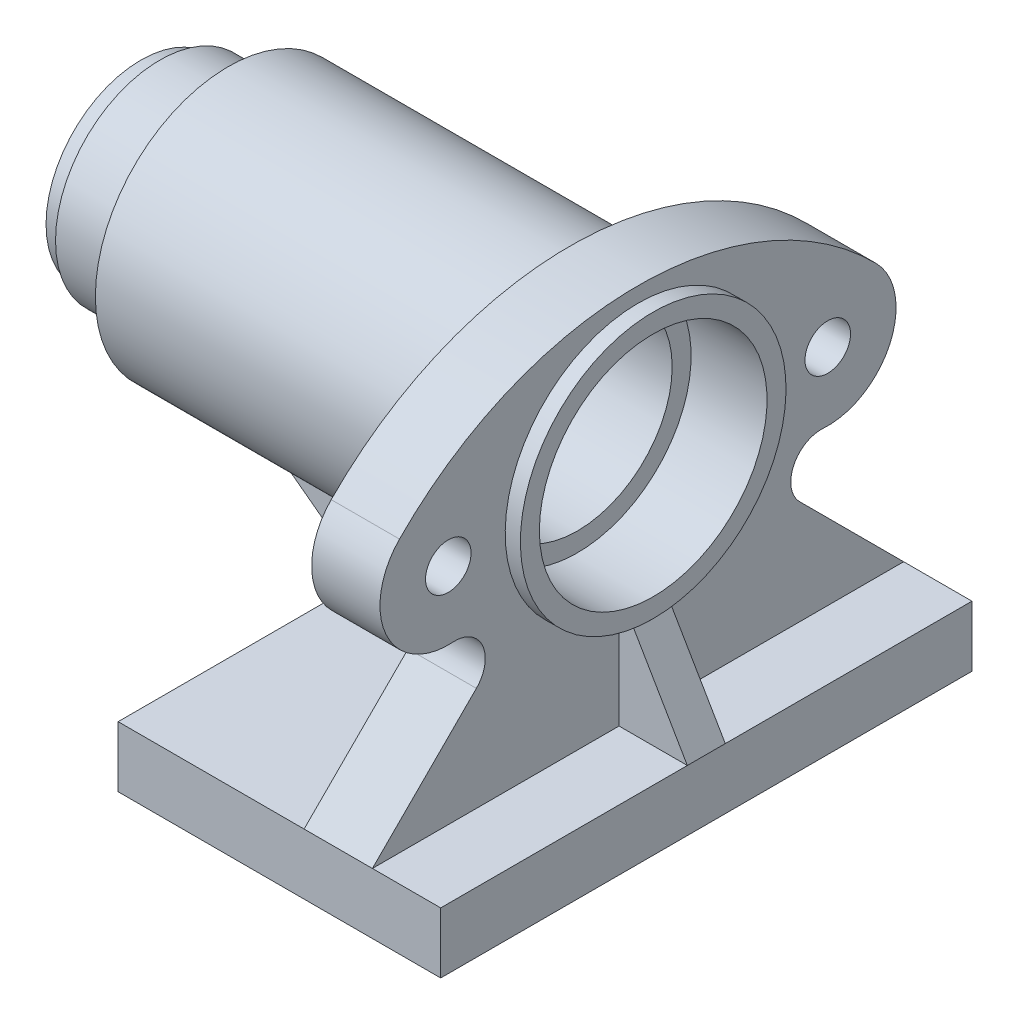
from build123d import *

# Parameters (mm, degrees)
SKETCH_1_W      = 85
SKETCH_1_H      = 16
EXTRUDE_2_DEPTH = 70
SKETCH_3_R      = 6
SKETCH_3_R_2    = 35
EXTRUDE_3_DEPTH = 18
RIB_1_REACH     = 202.248
SKETCH_4_WALL_W = 430.28121444
SKETCH_4_WALL_H = 10
RIB_2_REACH     = 202.248
SKETCH_5_WALL_W = 442.49632646
SKETCH_5_WALL_H = 10


with BuildPart() as part:
    # Sketch 1 → Extrude 2 (new, symmetric)
    with BuildSketch(Plane.XY):
        with Locations((-42.5, 8)):
            Rectangle(SKETCH_1_W, SKETCH_1_H)
    extrude(amount=EXTRUDE_2_DEPTH, both=True)



with BuildPart() as body_2:
    # Sketch 2 → Revolve 2 (revolve)
    with BuildSketch(Plane.XY, mode=Mode.PRIVATE) as revolve_2_sk:
        Polygon((-149, 91), (-149, 100), (-144, 100), (-144, 102.5), (-126, 102.5), (-126, 110), (-14, 110), (-14, 105), (-34, 105), (-34, 100), (-114, 100), (-114, 91), align=None)
    revolve(revolve_2_sk.sketch.rotate(Axis((-107.067924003, 75, 0), (1, 0, 0)), 90), axis=Axis((-107.067924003, 75, 0), (1, 0, 0)))


with BuildPart() as part_1:
    add(part.part)

    add(body_2.part)  # Extrude 3 merges body 2
    # Sketch 3 → Extrude 3 (add)
    with BuildSketch(Plane(origin=(-18, 0, 0), x_dir=(0, 0, -1), z_dir=(1, 0, 0))):
        with BuildLine():
            Line((-70, 16), (-42.598236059, 43.401763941))
            ThreePointArc((-42.598236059, 43.401763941), (-40.971009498, 52.366512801), (-48.791985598, 57.040581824))
            ThreePointArc((-48.791985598, 57.040581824), (-66.35099273, 67.473710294), (-62.857142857, 87.59737582))
            ThreePointArc((-62.857142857, 87.59737582), (0, 114.010205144), (62.857142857, 87.59737582))
            ThreePointArc((62.857142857, 87.59737582), (66.35099273, 67.473710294), (48.791985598, 57.040581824))
            ThreePointArc((48.791985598, 57.040581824), (40.971009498, 52.366512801), (42.598236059, 43.401763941))
            Line((42.598236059, 43.401763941), (70, 16))
            Line((70, 16), (-70, 16))
        make_face()
        with Locations((-50, 75)):
            Circle(SKETCH_3_R, mode=Mode.SUBTRACT)
        with Locations(Location((50, 75, 0), (0, 0, 180))):
            Circle(SKETCH_3_R, mode=Mode.SUBTRACT)
        with Locations(Location((0, 75, 0), (0, 0, 180))):
            Circle(SKETCH_3_R_2, mode=Mode.SUBTRACT)
    extrude(amount=-EXTRUDE_3_DEPTH)

    # Sketch 4 wall → Rib 1 (add, up to next)
    with BuildSketch(Plane(origin=(-7, 28, 0), x_dir=(-0.503871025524, 0.863778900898, 0), z_dir=(-0.863778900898, -0.503871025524, 0)), mode=Mode.PRIVATE) as rib_1_sk1:
        Rectangle(SKETCH_4_WALL_W, SKETCH_4_WALL_H)
    rib_1_tool1 = extrude(rib_1_sk1.sketch, amount=RIB_1_REACH, mode=Mode.PRIVATE) - part_1.part
    add(rib_1_tool1.solids().sort_by_distance((-7, 28, 0))[0])

    # Sketch 5 wall → Rib 2 (add, up to next)
    with BuildSketch(Plane(origin=(-101, 28, 0), x_dir=(-0.8, 0.6, 0), z_dir=(-0.6, -0.8, 0)), mode=Mode.PRIVATE) as rib_2_sk1:
        Rectangle(SKETCH_5_WALL_W, SKETCH_5_WALL_H)
    rib_2_tool1 = extrude(rib_2_sk1.sketch, amount=-RIB_2_REACH, mode=Mode.PRIVATE) - part_1.part
    add(rib_2_tool1.solids().sort_by_distance((-101, 28, 0))[0])


solid = part_1.part
